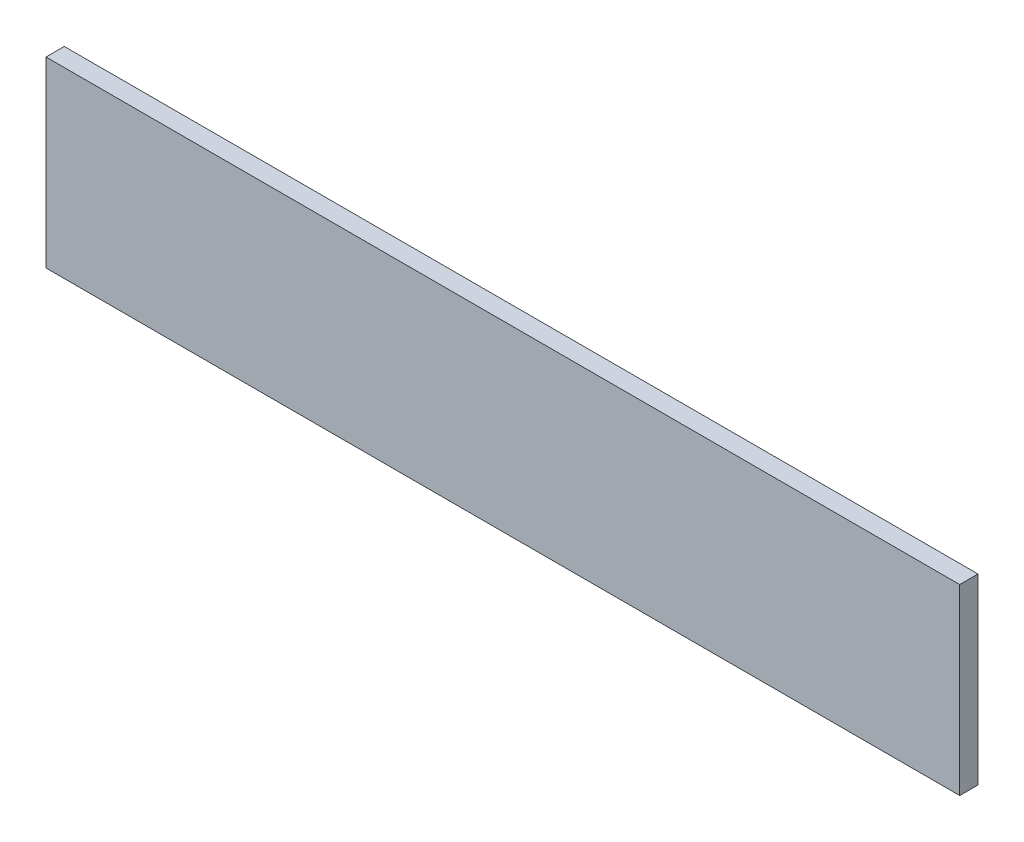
ISO-10303-21;
HEADER;
FILE_DESCRIPTION(('STEP AP214'),'2;1');
FILE_NAME('part.step','',(''),(''),'','','');
FILE_SCHEMA(('AUTOMOTIVE_DESIGN { 1 0 10303 214 1 1 1 1 }'));
ENDSEC;
DATA;
#1=APPLICATION_CONTEXT('core data for automotive mechanical design processes');
#2=APPLICATION_PROTOCOL_DEFINITION('international standard','automotive_design',2000,#1);
#3=PRODUCT_CONTEXT('',#1,'mechanical');
#4=PRODUCT('Part','Part','',(#3));
#5=PRODUCT_RELATED_PRODUCT_CATEGORY('part','',(#4));
#6=PRODUCT_DEFINITION_FORMATION('','',#4);
#7=PRODUCT_DEFINITION_CONTEXT('part definition',#1,'design');
#8=PRODUCT_DEFINITION('design','',#6,#7);
#9=PRODUCT_DEFINITION_SHAPE('','',#8);
#10=(LENGTH_UNIT() NAMED_UNIT(*) SI_UNIT(.MILLI.,.METRE.));
#11=(NAMED_UNIT(*) PLANE_ANGLE_UNIT() SI_UNIT($,.RADIAN.));
#12=(NAMED_UNIT(*) SI_UNIT($,.STERADIAN.) SOLID_ANGLE_UNIT());
#13=UNCERTAINTY_MEASURE_WITH_UNIT(LENGTH_MEASURE(1.E-05),#10,'distance_accuracy_value','');
#14=(GEOMETRIC_REPRESENTATION_CONTEXT(3) GLOBAL_UNCERTAINTY_ASSIGNED_CONTEXT((#13)) GLOBAL_UNIT_ASSIGNED_CONTEXT((#10,
#11,#12)) REPRESENTATION_CONTEXT('',''));
#15=CARTESIAN_POINT('',(0.,0.,0.));
#16=DIRECTION('',(0.,0.,1.));
#17=DIRECTION('',(1.,0.,0.));
#18=AXIS2_PLACEMENT_3D('',#15,#16,#17);
#19=CARTESIAN_POINT('',(-0.848950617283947,0.,10.));
#20=DIRECTION('',(1.,0.,0.));
#21=DIRECTION('',(0.,1.,0.));
#22=AXIS2_PLACEMENT_3D('',#19,#20,#21);
#23=PLANE('',#22);
#24=DIRECTION('',(0.,-1.,0.));
#25=VECTOR('',#24,1.);
#26=CARTESIAN_POINT('',(-0.848950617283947,0.,0.));
#27=LINE('',#26,#25);
#28=CARTESIAN_POINT('',(-0.848950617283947,0.,0.));
#29=VERTEX_POINT('',#28);
#30=CARTESIAN_POINT('',(-0.848950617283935,-100.,0.));
#31=VERTEX_POINT('',#30);
#32=EDGE_CURVE('E79',#29,#31,#27,.T.);
#33=ORIENTED_EDGE('',*,*,#32,.T.);
#34=DIRECTION('',(0.,0.,-1.));
#35=VECTOR('',#34,1.);
#36=CARTESIAN_POINT('',(-0.848950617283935,-100.,10.));
#37=LINE('',#36,#35);
#38=CARTESIAN_POINT('',(-0.848950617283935,-100.,10.));
#39=VERTEX_POINT('',#38);
#40=EDGE_CURVE('E11',#39,#31,#37,.T.);
#41=ORIENTED_EDGE('',*,*,#40,.F.);
#42=DIRECTION('',(0.,-1.,0.));
#43=VECTOR('',#42,1.);
#44=CARTESIAN_POINT('',(-0.848950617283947,0.,10.));
#45=LINE('',#44,#43);
#46=CARTESIAN_POINT('',(-0.848950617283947,0.,10.));
#47=VERTEX_POINT('',#46);
#48=EDGE_CURVE('E102',#47,#39,#45,.T.);
#49=ORIENTED_EDGE('',*,*,#48,.F.);
#50=DIRECTION('',(0.,0.,-1.));
#51=VECTOR('',#50,1.);
#52=CARTESIAN_POINT('',(-0.848950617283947,0.,10.));
#53=LINE('',#52,#51);
#54=EDGE_CURVE('E91',#47,#29,#53,.T.);
#55=ORIENTED_EDGE('',*,*,#54,.T.);
#56=EDGE_LOOP('',(#33,#41,#49,#55));
#57=FACE_BOUND('',#56,.T.);
#58=ADVANCED_FACE('F35',(#57),#23,.F.);
#59=CARTESIAN_POINT('',(-0.848950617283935,-100.,10.));
#60=DIRECTION('',(0.,1.,0.));
#61=DIRECTION('',(0.,0.,1.));
#62=AXIS2_PLACEMENT_3D('',#59,#60,#61);
#63=PLANE('',#62);
#64=DIRECTION('',(1.,0.,0.));
#65=VECTOR('',#64,1.);
#66=CARTESIAN_POINT('',(-0.848950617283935,-100.,0.));
#67=LINE('',#66,#65);
#68=CARTESIAN_POINT('',(499.151049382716,-100.,0.));
#69=VERTEX_POINT('',#68);
#70=EDGE_CURVE('E75',#31,#69,#67,.T.);
#71=ORIENTED_EDGE('',*,*,#70,.T.);
#72=DIRECTION('',(0.,0.,-1.));
#73=VECTOR('',#72,1.);
#74=CARTESIAN_POINT('',(499.151049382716,-100.,10.));
#75=LINE('',#74,#73);
#76=CARTESIAN_POINT('',(499.151049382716,-100.,10.));
#77=VERTEX_POINT('',#76);
#78=EDGE_CURVE('E42',#77,#69,#75,.T.);
#79=ORIENTED_EDGE('',*,*,#78,.F.);
#80=DIRECTION('',(1.,0.,0.));
#81=VECTOR('',#80,1.);
#82=CARTESIAN_POINT('',(-0.848950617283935,-100.,10.));
#83=LINE('',#82,#81);
#84=EDGE_CURVE('E87',#39,#77,#83,.T.);
#85=ORIENTED_EDGE('',*,*,#84,.F.);
#86=ORIENTED_EDGE('',*,*,#40,.T.);
#87=EDGE_LOOP('',(#71,#79,#85,#86));
#88=FACE_BOUND('',#87,.T.);
#89=ADVANCED_FACE('F86',(#88),#63,.F.);
#90=CARTESIAN_POINT('',(499.151049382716,0.,10.));
#91=DIRECTION('',(-1.,0.,0.));
#92=DIRECTION('',(0.,0.,1.));
#93=AXIS2_PLACEMENT_3D('',#90,#91,#92);
#94=PLANE('',#93);
#95=DIRECTION('',(0.,1.,0.));
#96=VECTOR('',#95,1.);
#97=CARTESIAN_POINT('',(499.151049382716,0.,0.));
#98=LINE('',#97,#96);
#99=CARTESIAN_POINT('',(499.151049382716,0.,0.));
#100=VERTEX_POINT('',#99);
#101=EDGE_CURVE('E80',#69,#100,#98,.T.);
#102=ORIENTED_EDGE('',*,*,#101,.T.);
#103=DIRECTION('',(0.,0.,-1.));
#104=VECTOR('',#103,1.);
#105=CARTESIAN_POINT('',(499.151049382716,0.,10.));
#106=LINE('',#105,#104);
#107=CARTESIAN_POINT('',(499.151049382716,0.,10.));
#108=VERTEX_POINT('',#107);
#109=EDGE_CURVE('E111',#108,#100,#106,.T.);
#110=ORIENTED_EDGE('',*,*,#109,.F.);
#111=DIRECTION('',(0.,1.,0.));
#112=VECTOR('',#111,1.);
#113=CARTESIAN_POINT('',(499.151049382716,0.,10.));
#114=LINE('',#113,#112);
#115=EDGE_CURVE('E54',#77,#108,#114,.T.);
#116=ORIENTED_EDGE('',*,*,#115,.F.);
#117=ORIENTED_EDGE('',*,*,#78,.T.);
#118=EDGE_LOOP('',(#102,#110,#116,#117));
#119=FACE_BOUND('',#118,.T.);
#120=ADVANCED_FACE('F114',(#119),#94,.F.);
#121=CARTESIAN_POINT('',(-0.848950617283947,0.,10.));
#122=DIRECTION('',(0.,-1.,0.));
#123=DIRECTION('',(0.,0.,-1.));
#124=AXIS2_PLACEMENT_3D('',#121,#122,#123);
#125=PLANE('',#124);
#126=DIRECTION('',(-1.,0.,0.));
#127=VECTOR('',#126,1.);
#128=CARTESIAN_POINT('',(-0.848950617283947,0.,0.));
#129=LINE('',#128,#127);
#130=EDGE_CURVE('E99',#100,#29,#129,.T.);
#131=ORIENTED_EDGE('',*,*,#130,.T.);
#132=ORIENTED_EDGE('',*,*,#54,.F.);
#133=DIRECTION('',(-1.,0.,0.));
#134=VECTOR('',#133,1.);
#135=CARTESIAN_POINT('',(-0.848950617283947,0.,10.));
#136=LINE('',#135,#134);
#137=EDGE_CURVE('E49',#108,#47,#136,.T.);
#138=ORIENTED_EDGE('',*,*,#137,.F.);
#139=ORIENTED_EDGE('',*,*,#109,.T.);
#140=EDGE_LOOP('',(#131,#132,#138,#139));
#141=FACE_BOUND('',#140,.T.);
#142=ADVANCED_FACE('F116',(#141),#125,.F.);
#143=CARTESIAN_POINT('',(-0.848950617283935,-100.,10.));
#144=DIRECTION('',(0.,0.,1.));
#145=DIRECTION('',(1.,0.,0.));
#146=AXIS2_PLACEMENT_3D('',#143,#144,#145);
#147=PLANE('',#146);
#148=ORIENTED_EDGE('',*,*,#48,.T.);
#149=ORIENTED_EDGE('',*,*,#84,.T.);
#150=ORIENTED_EDGE('',*,*,#115,.T.);
#151=ORIENTED_EDGE('',*,*,#137,.T.);
#152=EDGE_LOOP('',(#148,#149,#150,#151));
#153=FACE_BOUND('',#152,.T.);
#154=ADVANCED_FACE('F117',(#153),#147,.T.);
#155=CARTESIAN_POINT('',(-0.848950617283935,-100.,0.));
#156=DIRECTION('',(0.,0.,1.));
#157=DIRECTION('',(1.,0.,0.));
#158=AXIS2_PLACEMENT_3D('',#155,#156,#157);
#159=PLANE('',#158);
#160=ORIENTED_EDGE('',*,*,#32,.F.);
#161=ORIENTED_EDGE('',*,*,#130,.F.);
#162=ORIENTED_EDGE('',*,*,#101,.F.);
#163=ORIENTED_EDGE('',*,*,#70,.F.);
#164=EDGE_LOOP('',(#160,#161,#162,#163));
#165=FACE_BOUND('',#164,.T.);
#166=ADVANCED_FACE('F76',(#165),#159,.F.);
#167=CLOSED_SHELL('',(#58,#89,#120,#142,#154,#166));
#168=MANIFOLD_SOLID_BREP('B2',#167);
#169=ADVANCED_BREP_SHAPE_REPRESENTATION('',(#18,#168),#14);
#170=SHAPE_DEFINITION_REPRESENTATION(#9,#169);
ENDSEC;
END-ISO-10303-21;
